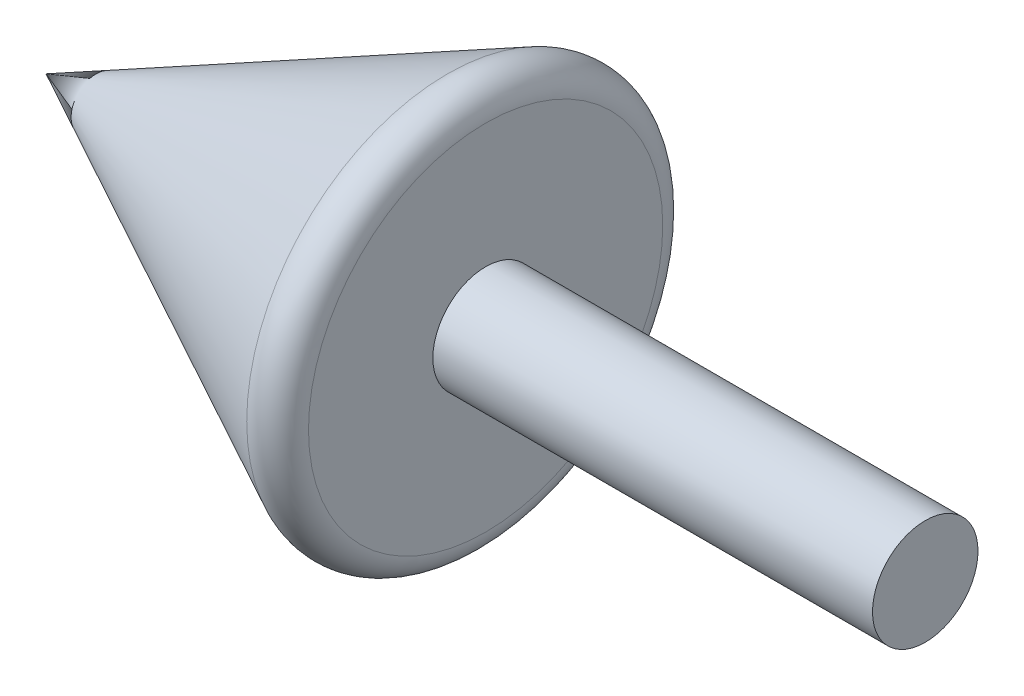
ISO-10303-21;
HEADER;
FILE_DESCRIPTION(('STEP AP214'),'2;1');
FILE_NAME('part.step','',(''),(''),'','','');
FILE_SCHEMA(('AUTOMOTIVE_DESIGN { 1 0 10303 214 1 1 1 1 }'));
ENDSEC;
DATA;
#1=APPLICATION_CONTEXT('core data for automotive mechanical design processes');
#2=APPLICATION_PROTOCOL_DEFINITION('international standard','automotive_design',2000,#1);
#3=PRODUCT_CONTEXT('',#1,'mechanical');
#4=PRODUCT('Part','Part','',(#3));
#5=PRODUCT_RELATED_PRODUCT_CATEGORY('part','',(#4));
#6=PRODUCT_DEFINITION_FORMATION('','',#4);
#7=PRODUCT_DEFINITION_CONTEXT('part definition',#1,'design');
#8=PRODUCT_DEFINITION('design','',#6,#7);
#9=PRODUCT_DEFINITION_SHAPE('','',#8);
#10=(LENGTH_UNIT() NAMED_UNIT(*) SI_UNIT(.MILLI.,.METRE.));
#11=(NAMED_UNIT(*) PLANE_ANGLE_UNIT() SI_UNIT($,.RADIAN.));
#12=(NAMED_UNIT(*) SI_UNIT($,.STERADIAN.) SOLID_ANGLE_UNIT());
#13=UNCERTAINTY_MEASURE_WITH_UNIT(LENGTH_MEASURE(1.E-05),#10,'distance_accuracy_value','');
#14=(GEOMETRIC_REPRESENTATION_CONTEXT(3) GLOBAL_UNCERTAINTY_ASSIGNED_CONTEXT((#13)) GLOBAL_UNIT_ASSIGNED_CONTEXT((#10,
#11,#12)) REPRESENTATION_CONTEXT('',''));
#15=CARTESIAN_POINT('',(0.,0.,0.));
#16=DIRECTION('',(0.,0.,1.));
#17=DIRECTION('',(1.,0.,0.));
#18=AXIS2_PLACEMENT_3D('',#15,#16,#17);
#19=CARTESIAN_POINT('',(50.,0.,0.));
#20=DIRECTION('',(-1.,0.,0.));
#21=DIRECTION('',(0.,0.,1.));
#22=AXIS2_PLACEMENT_3D('',#19,#20,#21);
#23=PLANE('',#22);
#24=CARTESIAN_POINT('',(50.,0.,0.));
#25=DIRECTION('',(-1.,0.,0.));
#26=DIRECTION('',(0.,0.,1.));
#27=AXIS2_PLACEMENT_3D('',#24,#25,#26);
#28=CIRCLE('',#27,6.);
#29=CARTESIAN_POINT('',(50.,0.,6.));
#30=VERTEX_POINT('',#29);
#31=EDGE_CURVE('E11',#30,#30,#28,.F.);
#32=ORIENTED_EDGE('',*,*,#31,.F.);
#33=EDGE_LOOP('',(#32));
#34=FACE_BOUND('',#33,.T.);
#35=CARTESIAN_POINT('',(50.,0.,0.));
#36=DIRECTION('',(-1.,0.,0.));
#37=DIRECTION('',(0.,0.,1.));
#38=AXIS2_PLACEMENT_3D('',#35,#36,#37);
#39=CIRCLE('',#38,20.1458980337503);
#40=CARTESIAN_POINT('',(50.,0.,20.1458980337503));
#41=VERTEX_POINT('',#40);
#42=EDGE_CURVE('E47',#41,#41,#39,.F.);
#43=ORIENTED_EDGE('',*,*,#42,.T.);
#44=EDGE_LOOP('',(#43));
#45=FACE_BOUND('',#44,.T.);
#46=ADVANCED_FACE('F39',(#34,#45),#23,.F.);
#47=CARTESIAN_POINT('',(50.,0.,0.));
#48=DIRECTION('',(1.,0.,0.));
#49=DIRECTION('',(0.,0.,-1.));
#50=AXIS2_PLACEMENT_3D('',#47,#48,#49);
#51=CONICAL_SURFACE('',#50,25.,0.463647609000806);
#52=CARTESIAN_POINT('',(45.6583592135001,0.,0.));
#53=DIRECTION('',(-1.,0.,0.));
#54=DIRECTION('',(0.,0.,1.));
#55=AXIS2_PLACEMENT_3D('',#52,#53,#54);
#56=CIRCLE('',#55,22.8291796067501);
#57=CARTESIAN_POINT('',(45.6583592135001,0.,22.8291796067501));
#58=VERTEX_POINT('',#57);
#59=EDGE_CURVE('E75',#58,#58,#56,.T.);
#60=ORIENTED_EDGE('',*,*,#59,.T.);
#61=EDGE_LOOP('',(#60));
#62=FACE_BOUND('',#61,.T.);
#63=CARTESIAN_POINT('',(0.,0.,0.));
#64=VERTEX_POINT('',#63);
#65=VERTEX_LOOP('',#64);
#66=FACE_BOUND('',#65,.T.);
#67=ADVANCED_FACE('F50',(#62,#66),#51,.T.);
#68=CARTESIAN_POINT('',(47.,0.,0.));
#69=DIRECTION('',(-1.,0.,0.));
#70=DIRECTION('',(0.,0.,1.));
#71=AXIS2_PLACEMENT_3D('',#68,#69,#70);
#72=TOROIDAL_SURFACE('',#71,20.1458980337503,3.);
#73=ORIENTED_EDGE('',*,*,#42,.F.);
#74=EDGE_LOOP('',(#73));
#75=FACE_BOUND('',#74,.T.);
#76=ORIENTED_EDGE('',*,*,#59,.F.);
#77=EDGE_LOOP('',(#76));
#78=FACE_BOUND('',#77,.T.);
#79=ADVANCED_FACE('F41',(#75,#78),#72,.T.);
#80=CARTESIAN_POINT('',(100.,0.,0.));
#81=DIRECTION('',(-1.,0.,0.));
#82=DIRECTION('',(0.,0.,1.));
#83=AXIS2_PLACEMENT_3D('',#80,#81,#82);
#84=CYLINDRICAL_SURFACE('',#83,6.);
#85=CARTESIAN_POINT('',(100.,0.,0.));
#86=DIRECTION('',(1.,0.,0.));
#87=DIRECTION('',(0.,0.,-1.));
#88=AXIS2_PLACEMENT_3D('',#85,#86,#87);
#89=CIRCLE('',#88,6.);
#90=CARTESIAN_POINT('',(100.,0.,-6.));
#91=VERTEX_POINT('',#90);
#92=EDGE_CURVE('E73',#91,#91,#89,.T.);
#93=ORIENTED_EDGE('',*,*,#92,.F.);
#94=EDGE_LOOP('',(#93));
#95=FACE_BOUND('',#94,.T.);
#96=ORIENTED_EDGE('',*,*,#31,.T.);
#97=EDGE_LOOP('',(#96));
#98=FACE_BOUND('',#97,.T.);
#99=ADVANCED_FACE('F58',(#95,#98),#84,.T.);
#100=CARTESIAN_POINT('',(100.,0.,0.));
#101=DIRECTION('',(1.,0.,0.));
#102=DIRECTION('',(0.,0.,-1.));
#103=AXIS2_PLACEMENT_3D('',#100,#101,#102);
#104=PLANE('',#103);
#105=ORIENTED_EDGE('',*,*,#92,.T.);
#106=EDGE_LOOP('',(#105));
#107=FACE_BOUND('',#106,.T.);
#108=ADVANCED_FACE('F65',(#107),#104,.T.);
#109=CLOSED_SHELL('',(#46,#67,#79,#99,#108));
#110=MANIFOLD_SOLID_BREP('B2',#109);
#111=ADVANCED_BREP_SHAPE_REPRESENTATION('',(#18,#110),#14);
#112=SHAPE_DEFINITION_REPRESENTATION(#9,#111);
ENDSEC;
END-ISO-10303-21;
